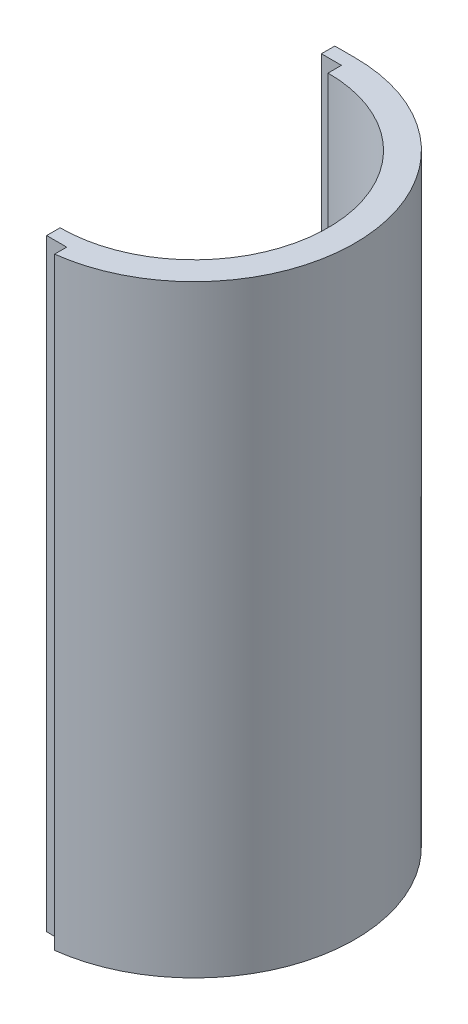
ISO-10303-21;
HEADER;
FILE_DESCRIPTION(('STEP AP214'),'2;1');
FILE_NAME('part.step','',(''),(''),'','','');
FILE_SCHEMA(('AUTOMOTIVE_DESIGN { 1 0 10303 214 1 1 1 1 }'));
ENDSEC;
DATA;
#1=APPLICATION_CONTEXT('core data for automotive mechanical design processes');
#2=APPLICATION_PROTOCOL_DEFINITION('international standard','automotive_design',2000,#1);
#3=PRODUCT_CONTEXT('',#1,'mechanical');
#4=PRODUCT('Part','Part','',(#3));
#5=PRODUCT_RELATED_PRODUCT_CATEGORY('part','',(#4));
#6=PRODUCT_DEFINITION_FORMATION('','',#4);
#7=PRODUCT_DEFINITION_CONTEXT('part definition',#1,'design');
#8=PRODUCT_DEFINITION('design','',#6,#7);
#9=PRODUCT_DEFINITION_SHAPE('','',#8);
#10=(LENGTH_UNIT() NAMED_UNIT(*) SI_UNIT(.MILLI.,.METRE.));
#11=(NAMED_UNIT(*) PLANE_ANGLE_UNIT() SI_UNIT($,.RADIAN.));
#12=(NAMED_UNIT(*) SI_UNIT($,.STERADIAN.) SOLID_ANGLE_UNIT());
#13=UNCERTAINTY_MEASURE_WITH_UNIT(LENGTH_MEASURE(1.E-05),#10,'distance_accuracy_value','');
#14=(GEOMETRIC_REPRESENTATION_CONTEXT(3) GLOBAL_UNCERTAINTY_ASSIGNED_CONTEXT((#13)) GLOBAL_UNIT_ASSIGNED_CONTEXT((#10,
#11,#12)) REPRESENTATION_CONTEXT('',''));
#15=CARTESIAN_POINT('',(0.,0.,0.));
#16=DIRECTION('',(0.,0.,1.));
#17=DIRECTION('',(1.,0.,0.));
#18=AXIS2_PLACEMENT_3D('',#15,#16,#17);
#19=CARTESIAN_POINT('',(0.,45.,-10.));
#20=DIRECTION('',(1.,0.,0.));
#21=DIRECTION('',(0.,0.,-1.));
#22=AXIS2_PLACEMENT_3D('',#19,#20,#21);
#23=PLANE('',#22);
#24=DIRECTION('',(0.,-1.,0.));
#25=VECTOR('',#24,1.);
#26=CARTESIAN_POINT('',(0.,46.7999627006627,-11.));
#27=LINE('',#26,#25);
#28=CARTESIAN_POINT('',(0.,45.,-11.));
#29=VERTEX_POINT('',#28);
#30=CARTESIAN_POINT('',(0.,0.,-11.));
#31=VERTEX_POINT('',#30);
#32=EDGE_CURVE('E48',#29,#31,#27,.T.);
#33=ORIENTED_EDGE('',*,*,#32,.T.);
#34=DIRECTION('',(0.,0.,1.));
#35=VECTOR('',#34,1.);
#36=CARTESIAN_POINT('',(0.,0.,-10.));
#37=LINE('',#36,#35);
#38=CARTESIAN_POINT('',(0.,0.,-10.));
#39=VERTEX_POINT('',#38);
#40=EDGE_CURVE('E130',#31,#39,#37,.T.);
#41=ORIENTED_EDGE('',*,*,#40,.T.);
#42=DIRECTION('',(0.,-1.,0.));
#43=VECTOR('',#42,1.);
#44=CARTESIAN_POINT('',(0.,45.,-10.));
#45=LINE('',#44,#43);
#46=CARTESIAN_POINT('',(0.,45.,-10.));
#47=VERTEX_POINT('',#46);
#48=EDGE_CURVE('E117',#47,#39,#45,.T.);
#49=ORIENTED_EDGE('',*,*,#48,.F.);
#50=DIRECTION('',(0.,0.,1.));
#51=VECTOR('',#50,1.);
#52=CARTESIAN_POINT('',(0.,45.,-10.));
#53=LINE('',#52,#51);
#54=EDGE_CURVE('E141',#29,#47,#53,.T.);
#55=ORIENTED_EDGE('',*,*,#54,.F.);
#56=EDGE_LOOP('',(#33,#41,#49,#55));
#57=FACE_BOUND('',#56,.T.);
#58=ADVANCED_FACE('F33',(#57),#23,.F.);
#59=CARTESIAN_POINT('',(0.,45.,10.));
#60=DIRECTION('',(1.,0.,0.));
#61=DIRECTION('',(0.,0.,-1.));
#62=AXIS2_PLACEMENT_3D('',#59,#60,#61);
#63=PLANE('',#62);
#64=DIRECTION('',(0.,-1.,0.));
#65=VECTOR('',#64,1.);
#66=CARTESIAN_POINT('',(0.,60.,11.));
#67=LINE('',#66,#65);
#68=CARTESIAN_POINT('',(0.,45.,11.));
#69=VERTEX_POINT('',#68);
#70=CARTESIAN_POINT('',(0.,0.,11.));
#71=VERTEX_POINT('',#70);
#72=EDGE_CURVE('E56',#69,#71,#67,.T.);
#73=ORIENTED_EDGE('',*,*,#72,.F.);
#74=DIRECTION('',(0.,0.,1.));
#75=VECTOR('',#74,1.);
#76=CARTESIAN_POINT('',(0.,45.,10.));
#77=LINE('',#76,#75);
#78=CARTESIAN_POINT('',(0.,45.,10.));
#79=VERTEX_POINT('',#78);
#80=EDGE_CURVE('E148',#79,#69,#77,.T.);
#81=ORIENTED_EDGE('',*,*,#80,.F.);
#82=DIRECTION('',(0.,-1.,0.));
#83=VECTOR('',#82,1.);
#84=CARTESIAN_POINT('',(0.,45.,10.));
#85=LINE('',#84,#83);
#86=CARTESIAN_POINT('',(0.,0.,10.));
#87=VERTEX_POINT('',#86);
#88=EDGE_CURVE('E41',#79,#87,#85,.T.);
#89=ORIENTED_EDGE('',*,*,#88,.T.);
#90=DIRECTION('',(0.,0.,1.));
#91=VECTOR('',#90,1.);
#92=CARTESIAN_POINT('',(0.,0.,10.));
#93=LINE('',#92,#91);
#94=EDGE_CURVE('E131',#87,#71,#93,.T.);
#95=ORIENTED_EDGE('',*,*,#94,.T.);
#96=EDGE_LOOP('',(#73,#81,#89,#95));
#97=FACE_BOUND('',#96,.T.);
#98=ADVANCED_FACE('F146',(#97),#63,.F.);
#99=CARTESIAN_POINT('',(0.,45.,0.));
#100=DIRECTION('',(0.,-1.,0.));
#101=DIRECTION('',(0.,0.,-1.));
#102=AXIS2_PLACEMENT_3D('',#99,#100,#101);
#103=CYLINDRICAL_SURFACE('',#102,12.);
#104=DIRECTION('',(0.,-1.,0.));
#105=VECTOR('',#104,1.);
#106=CARTESIAN_POINT('',(1.49947506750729,45.,11.9059470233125));
#107=LINE('',#106,#105);
#108=CARTESIAN_POINT('',(1.49947506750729,0.,11.9059470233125));
#109=VERTEX_POINT('',#108);
#110=CARTESIAN_POINT('',(1.49947506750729,45.,11.9059470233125));
#111=VERTEX_POINT('',#110);
#112=EDGE_CURVE('E129',#109,#111,#107,.F.);
#113=ORIENTED_EDGE('',*,*,#112,.F.);
#114=CARTESIAN_POINT('',(0.,0.,0.));
#115=DIRECTION('',(0.,1.,0.));
#116=DIRECTION('',(0.,0.,1.));
#117=AXIS2_PLACEMENT_3D('',#114,#115,#116);
#118=CIRCLE('',#117,12.);
#119=CARTESIAN_POINT('',(0.,0.,-12.));
#120=VERTEX_POINT('',#119);
#121=EDGE_CURVE('E122',#109,#120,#118,.T.);
#122=ORIENTED_EDGE('',*,*,#121,.T.);
#123=DIRECTION('',(0.,-1.,0.));
#124=VECTOR('',#123,1.);
#125=CARTESIAN_POINT('',(0.,45.,-12.));
#126=LINE('',#125,#124);
#127=CARTESIAN_POINT('',(0.,45.,-12.));
#128=VERTEX_POINT('',#127);
#129=EDGE_CURVE('E106',#128,#120,#126,.T.);
#130=ORIENTED_EDGE('',*,*,#129,.F.);
#131=CARTESIAN_POINT('',(0.,45.,0.));
#132=DIRECTION('',(0.,1.,0.));
#133=DIRECTION('',(0.,0.,1.));
#134=AXIS2_PLACEMENT_3D('',#131,#132,#133);
#135=CIRCLE('',#134,12.);
#136=EDGE_CURVE('E159',#111,#128,#135,.T.);
#137=ORIENTED_EDGE('',*,*,#136,.F.);
#138=EDGE_LOOP('',(#113,#122,#130,#137));
#139=FACE_BOUND('',#138,.T.);
#140=ADVANCED_FACE('F128',(#139),#103,.T.);
#141=CARTESIAN_POINT('',(0.,45.,0.));
#142=DIRECTION('',(0.,-1.,0.));
#143=DIRECTION('',(0.,0.,-1.));
#144=AXIS2_PLACEMENT_3D('',#141,#142,#143);
#145=PLANE('',#144);
#146=DIRECTION('',(0.,0.,-1.));
#147=VECTOR('',#146,1.);
#148=CARTESIAN_POINT('',(1.49947506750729,45.,0.));
#149=LINE('',#148,#147);
#150=CARTESIAN_POINT('',(1.49947506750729,45.,11.));
#151=VERTEX_POINT('',#150);
#152=EDGE_CURVE('E155',#111,#151,#149,.T.);
#153=ORIENTED_EDGE('',*,*,#152,.F.);
#154=ORIENTED_EDGE('',*,*,#136,.T.);
#155=DIRECTION('',(1.,0.,0.));
#156=VECTOR('',#155,1.);
#157=CARTESIAN_POINT('',(0.,45.,-12.));
#158=LINE('',#157,#156);
#159=CARTESIAN_POINT('',(-1.49661809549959,45.,-12.));
#160=VERTEX_POINT('',#159);
#161=EDGE_CURVE('E112',#160,#128,#158,.T.);
#162=ORIENTED_EDGE('',*,*,#161,.F.);
#163=DIRECTION('',(0.,0.,-1.));
#164=VECTOR('',#163,1.);
#165=CARTESIAN_POINT('',(-1.49661809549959,45.,-11.));
#166=LINE('',#165,#164);
#167=CARTESIAN_POINT('',(-1.49661809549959,45.,-11.));
#168=VERTEX_POINT('',#167);
#169=EDGE_CURVE('E173',#168,#160,#166,.T.);
#170=ORIENTED_EDGE('',*,*,#169,.F.);
#171=DIRECTION('',(-1.,0.,0.));
#172=VECTOR('',#171,1.);
#173=CARTESIAN_POINT('',(0.,45.,-11.));
#174=LINE('',#173,#172);
#175=EDGE_CURVE('E171',#29,#168,#174,.T.);
#176=ORIENTED_EDGE('',*,*,#175,.F.);
#177=ORIENTED_EDGE('',*,*,#54,.T.);
#178=CARTESIAN_POINT('',(0.,45.,0.));
#179=DIRECTION('',(0.,-1.,0.));
#180=DIRECTION('',(0.,0.,-1.));
#181=AXIS2_PLACEMENT_3D('',#178,#179,#180);
#182=CIRCLE('',#181,10.);
#183=EDGE_CURVE('E133',#47,#79,#182,.T.);
#184=ORIENTED_EDGE('',*,*,#183,.T.);
#185=ORIENTED_EDGE('',*,*,#80,.T.);
#186=DIRECTION('',(-1.,0.,0.));
#187=VECTOR('',#186,1.);
#188=CARTESIAN_POINT('',(0.,45.,11.));
#189=LINE('',#188,#187);
#190=EDGE_CURVE('E164',#151,#69,#189,.T.);
#191=ORIENTED_EDGE('',*,*,#190,.F.);
#192=EDGE_LOOP('',(#153,#154,#162,#170,#176,#177,#184,#185,#191));
#193=FACE_BOUND('',#192,.T.);
#194=ADVANCED_FACE('F189',(#193),#145,.F.);
#195=CARTESIAN_POINT('',(0.,0.,0.));
#196=DIRECTION('',(0.,-1.,0.));
#197=DIRECTION('',(0.,0.,-1.));
#198=AXIS2_PLACEMENT_3D('',#195,#196,#197);
#199=PLANE('',#198);
#200=ORIENTED_EDGE('',*,*,#121,.F.);
#201=DIRECTION('',(0.,0.,-1.));
#202=VECTOR('',#201,1.);
#203=CARTESIAN_POINT('',(1.49947506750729,0.,0.));
#204=LINE('',#203,#202);
#205=CARTESIAN_POINT('',(1.49947506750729,0.,11.));
#206=VERTEX_POINT('',#205);
#207=EDGE_CURVE('E11',#109,#206,#204,.T.);
#208=ORIENTED_EDGE('',*,*,#207,.T.);
#209=DIRECTION('',(-1.,0.,0.));
#210=VECTOR('',#209,1.);
#211=CARTESIAN_POINT('',(0.,0.,11.));
#212=LINE('',#211,#210);
#213=EDGE_CURVE('E169',#206,#71,#212,.T.);
#214=ORIENTED_EDGE('',*,*,#213,.T.);
#215=ORIENTED_EDGE('',*,*,#94,.F.);
#216=CARTESIAN_POINT('',(0.,0.,0.));
#217=DIRECTION('',(0.,-1.,0.));
#218=DIRECTION('',(0.,0.,-1.));
#219=AXIS2_PLACEMENT_3D('',#216,#217,#218);
#220=CIRCLE('',#219,10.);
#221=EDGE_CURVE('E136',#39,#87,#220,.T.);
#222=ORIENTED_EDGE('',*,*,#221,.F.);
#223=ORIENTED_EDGE('',*,*,#40,.F.);
#224=DIRECTION('',(1.,0.,0.));
#225=VECTOR('',#224,1.);
#226=CARTESIAN_POINT('',(0.,0.,-11.));
#227=LINE('',#226,#225);
#228=CARTESIAN_POINT('',(-1.49661809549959,0.,-11.));
#229=VERTEX_POINT('',#228);
#230=EDGE_CURVE('E179',#229,#31,#227,.T.);
#231=ORIENTED_EDGE('',*,*,#230,.F.);
#232=DIRECTION('',(0.,0.,1.));
#233=VECTOR('',#232,1.);
#234=CARTESIAN_POINT('',(-1.49661809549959,0.,-11.));
#235=LINE('',#234,#233);
#236=CARTESIAN_POINT('',(-1.49661809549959,0.,-12.));
#237=VERTEX_POINT('',#236);
#238=EDGE_CURVE('E125',#237,#229,#235,.T.);
#239=ORIENTED_EDGE('',*,*,#238,.F.);
#240=DIRECTION('',(-1.,0.,0.));
#241=VECTOR('',#240,1.);
#242=CARTESIAN_POINT('',(0.,0.,-12.));
#243=LINE('',#242,#241);
#244=EDGE_CURVE('E110',#120,#237,#243,.T.);
#245=ORIENTED_EDGE('',*,*,#244,.F.);
#246=EDGE_LOOP('',(#200,#208,#214,#215,#222,#223,#231,#239,#245));
#247=FACE_BOUND('',#246,.T.);
#248=ADVANCED_FACE('F121',(#247),#199,.T.);
#249=CARTESIAN_POINT('',(0.,45.,0.));
#250=DIRECTION('',(0.,-1.,0.));
#251=DIRECTION('',(0.,0.,-1.));
#252=AXIS2_PLACEMENT_3D('',#249,#250,#251);
#253=CYLINDRICAL_SURFACE('',#252,10.);
#254=ORIENTED_EDGE('',*,*,#221,.T.);
#255=ORIENTED_EDGE('',*,*,#88,.F.);
#256=ORIENTED_EDGE('',*,*,#183,.F.);
#257=ORIENTED_EDGE('',*,*,#48,.T.);
#258=EDGE_LOOP('',(#254,#255,#256,#257));
#259=FACE_BOUND('',#258,.T.);
#260=ADVANCED_FACE('F35',(#259),#253,.F.);
#261=CARTESIAN_POINT('',(1.49947506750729,60.,11.));
#262=DIRECTION('',(-1.,0.,0.));
#263=DIRECTION('',(0.,0.,1.));
#264=AXIS2_PLACEMENT_3D('',#261,#262,#263);
#265=PLANE('',#264);
#266=ORIENTED_EDGE('',*,*,#112,.T.);
#267=ORIENTED_EDGE('',*,*,#152,.T.);
#268=DIRECTION('',(0.,-1.,0.));
#269=VECTOR('',#268,1.);
#270=CARTESIAN_POINT('',(1.49947506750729,60.,11.));
#271=LINE('',#270,#269);
#272=EDGE_CURVE('E166',#151,#206,#271,.T.);
#273=ORIENTED_EDGE('',*,*,#272,.T.);
#274=ORIENTED_EDGE('',*,*,#207,.F.);
#275=EDGE_LOOP('',(#266,#267,#273,#274));
#276=FACE_BOUND('',#275,.T.);
#277=ADVANCED_FACE('F194',(#276),#265,.T.);
#278=CARTESIAN_POINT('',(0.,60.,11.));
#279=DIRECTION('',(0.,0.,1.));
#280=DIRECTION('',(1.,0.,0.));
#281=AXIS2_PLACEMENT_3D('',#278,#279,#280);
#282=PLANE('',#281);
#283=ORIENTED_EDGE('',*,*,#190,.T.);
#284=ORIENTED_EDGE('',*,*,#72,.T.);
#285=ORIENTED_EDGE('',*,*,#213,.F.);
#286=ORIENTED_EDGE('',*,*,#272,.F.);
#287=EDGE_LOOP('',(#283,#284,#285,#286));
#288=FACE_BOUND('',#287,.T.);
#289=ADVANCED_FACE('F195',(#288),#282,.T.);
#290=CARTESIAN_POINT('',(0.,46.7999627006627,-11.));
#291=DIRECTION('',(0.,0.,-1.));
#292=DIRECTION('',(-1.,0.,0.));
#293=AXIS2_PLACEMENT_3D('',#290,#291,#292);
#294=PLANE('',#293);
#295=ORIENTED_EDGE('',*,*,#32,.F.);
#296=ORIENTED_EDGE('',*,*,#175,.T.);
#297=DIRECTION('',(0.,-1.,0.));
#298=VECTOR('',#297,1.);
#299=CARTESIAN_POINT('',(-1.49661809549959,46.7999627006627,-11.));
#300=LINE('',#299,#298);
#301=EDGE_CURVE('E176',#168,#229,#300,.T.);
#302=ORIENTED_EDGE('',*,*,#301,.T.);
#303=ORIENTED_EDGE('',*,*,#230,.T.);
#304=EDGE_LOOP('',(#295,#296,#302,#303));
#305=FACE_BOUND('',#304,.T.);
#306=ADVANCED_FACE('F197',(#305),#294,.F.);
#307=CARTESIAN_POINT('',(-1.49661809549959,46.7999627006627,-11.));
#308=DIRECTION('',(1.,0.,0.));
#309=DIRECTION('',(0.,0.,-1.));
#310=AXIS2_PLACEMENT_3D('',#307,#308,#309);
#311=PLANE('',#310);
#312=ORIENTED_EDGE('',*,*,#301,.F.);
#313=ORIENTED_EDGE('',*,*,#169,.T.);
#314=DIRECTION('',(0.,-1.,0.));
#315=VECTOR('',#314,1.);
#316=CARTESIAN_POINT('',(-1.49661809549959,46.7999627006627,-12.));
#317=LINE('',#316,#315);
#318=EDGE_CURVE('E174',#160,#237,#317,.T.);
#319=ORIENTED_EDGE('',*,*,#318,.T.);
#320=ORIENTED_EDGE('',*,*,#238,.T.);
#321=EDGE_LOOP('',(#312,#313,#319,#320));
#322=FACE_BOUND('',#321,.T.);
#323=ADVANCED_FACE('F186',(#322),#311,.F.);
#324=CARTESIAN_POINT('',(0.,46.7999627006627,-12.));
#325=DIRECTION('',(0.,0.,1.));
#326=DIRECTION('',(1.,0.,0.));
#327=AXIS2_PLACEMENT_3D('',#324,#325,#326);
#328=PLANE('',#327);
#329=ORIENTED_EDGE('',*,*,#318,.F.);
#330=ORIENTED_EDGE('',*,*,#161,.T.);
#331=ORIENTED_EDGE('',*,*,#129,.T.);
#332=ORIENTED_EDGE('',*,*,#244,.T.);
#333=EDGE_LOOP('',(#329,#330,#331,#332));
#334=FACE_BOUND('',#333,.T.);
#335=ADVANCED_FACE('F109',(#334),#328,.F.);
#336=CLOSED_SHELL('',(#58,#98,#140,#194,#248,#260,#277,#289,#306,#323,#335));
#337=MANIFOLD_SOLID_BREP('B2',#336);
#338=ADVANCED_BREP_SHAPE_REPRESENTATION('',(#18,#337),#14);
#339=SHAPE_DEFINITION_REPRESENTATION(#9,#338);
ENDSEC;
END-ISO-10303-21;
